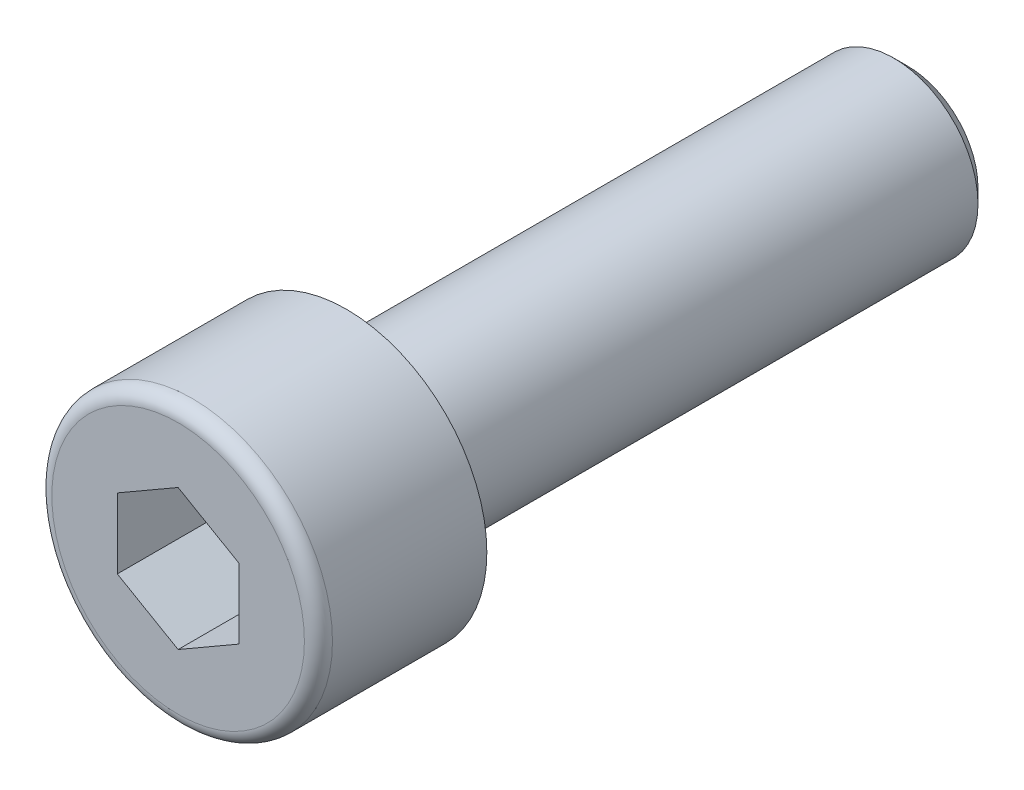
from build123d import *

# Parameters (mm, degrees)
ESQUISSE1_R             = 3
BASE_EXTRUSION_DEPTH    = 26
CHANFREIN1_SIZE         = 0.5
ESQUISSE2_R             = 5
BOSS_EXTRU_1_DEPTH      = 6
ENL_V_MAT_EXTRU_1_DEPTH = 3.5
CONG_2_R                = 0.5


with BuildPart() as part:
    # Esquisse1 → Base-Extrusion (new body)
    with BuildSketch(Plane.XY):
        Circle(ESQUISSE1_R)
    extrude(amount=BASE_EXTRUSION_DEPTH)

    # Chanfrein1
    chanfrein1_edges = [part.edges().sort_by_distance(p)[0] for p in [
        (-3, 0, 0),
    ]]
    chamfer(chanfrein1_edges, length=CHANFREIN1_SIZE)

    # Esquisse2 → Boss.-Extru.1 (add)
    with BuildSketch(Plane.XY.offset(20)):
        Circle(ESQUISSE2_R)
    extrude(amount=BOSS_EXTRU_1_DEPTH)

    # Esquisse3 → Enl_v. mat.-Extru.1 (cut)
    with BuildSketch(Plane.XY.offset(26)):
        Polygon((0, 2.5), (-2.165063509, 1.25), (-2.165063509, -1.25), (0, -2.5), (2.165063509, -1.25), (2.165063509, 1.25), align=None)
    extrude(amount=-ENL_V_MAT_EXTRU_1_DEPTH, mode=Mode.SUBTRACT)

    # Cong_2
    cong_2_edges = [part.edges().sort_by_distance(p)[0] for p in [
        (-5, 0, 26),
    ]]
    fillet(cong_2_edges, radius=CONG_2_R)


solid = part.part
